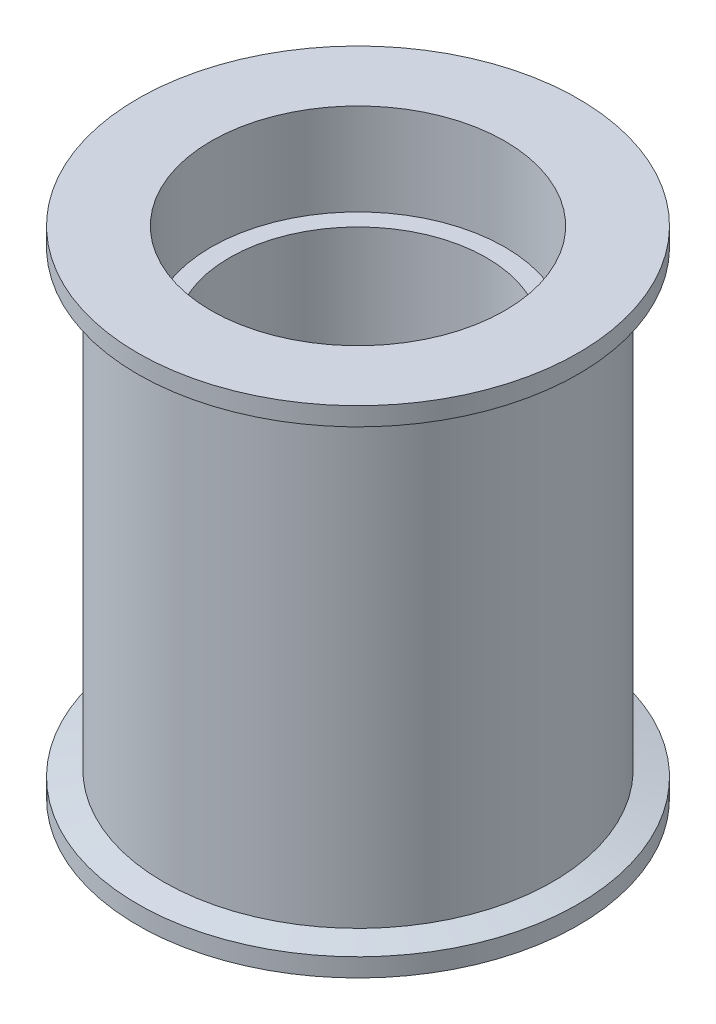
ISO-10303-21;
HEADER;
FILE_DESCRIPTION(('STEP AP214'),'2;1');
FILE_NAME('part.step','',(''),(''),'','','');
FILE_SCHEMA(('AUTOMOTIVE_DESIGN { 1 0 10303 214 1 1 1 1 }'));
ENDSEC;
DATA;
#1=APPLICATION_CONTEXT('core data for automotive mechanical design processes');
#2=APPLICATION_PROTOCOL_DEFINITION('international standard','automotive_design',2000,#1);
#3=PRODUCT_CONTEXT('',#1,'mechanical');
#4=PRODUCT('Part','Part','',(#3));
#5=PRODUCT_RELATED_PRODUCT_CATEGORY('part','',(#4));
#6=PRODUCT_DEFINITION_FORMATION('','',#4);
#7=PRODUCT_DEFINITION_CONTEXT('part definition',#1,'design');
#8=PRODUCT_DEFINITION('design','',#6,#7);
#9=PRODUCT_DEFINITION_SHAPE('','',#8);
#10=(LENGTH_UNIT() NAMED_UNIT(*) SI_UNIT(.MILLI.,.METRE.));
#11=(NAMED_UNIT(*) PLANE_ANGLE_UNIT() SI_UNIT($,.RADIAN.));
#12=(NAMED_UNIT(*) SI_UNIT($,.STERADIAN.) SOLID_ANGLE_UNIT());
#13=UNCERTAINTY_MEASURE_WITH_UNIT(LENGTH_MEASURE(1.E-05),#10,'distance_accuracy_value','');
#14=(GEOMETRIC_REPRESENTATION_CONTEXT(3) GLOBAL_UNCERTAINTY_ASSIGNED_CONTEXT((#13)) GLOBAL_UNIT_ASSIGNED_CONTEXT((#10,
#11,#12)) REPRESENTATION_CONTEXT('',''));
#15=CARTESIAN_POINT('',(0.,0.,0.));
#16=DIRECTION('',(0.,0.,1.));
#17=DIRECTION('',(1.,0.,0.));
#18=AXIS2_PLACEMENT_3D('',#15,#16,#17);
#19=CARTESIAN_POINT('',(0.,24.,0.));
#20=DIRECTION('',(0.,-1.,0.));
#21=DIRECTION('',(0.,0.,-1.));
#22=AXIS2_PLACEMENT_3D('',#19,#20,#21);
#23=CYLINDRICAL_SURFACE('',#22,10.6);
#24=CARTESIAN_POINT('',(0.,24.15,0.));
#25=DIRECTION('',(0.,1.,0.));
#26=DIRECTION('',(0.,0.,1.));
#27=AXIS2_PLACEMENT_3D('',#24,#25,#26);
#28=CIRCLE('',#27,10.6);
#29=CARTESIAN_POINT('',(0.,24.15,10.6));
#30=VERTEX_POINT('',#29);
#31=EDGE_CURVE('E10',#30,#30,#28,.F.);
#32=ORIENTED_EDGE('',*,*,#31,.T.);
#33=EDGE_LOOP('',(#32));
#34=FACE_BOUND('',#33,.T.);
#35=CARTESIAN_POINT('',(0.,-0.15,0.));
#36=DIRECTION('',(0.,-1.,0.));
#37=DIRECTION('',(0.,0.,-1.));
#38=AXIS2_PLACEMENT_3D('',#35,#36,#37);
#39=CIRCLE('',#38,10.6);
#40=CARTESIAN_POINT('',(0.,-0.15,-10.6));
#41=VERTEX_POINT('',#40);
#42=EDGE_CURVE('E39',#41,#41,#39,.F.);
#43=ORIENTED_EDGE('',*,*,#42,.T.);
#44=EDGE_LOOP('',(#43));
#45=FACE_BOUND('',#44,.T.);
#46=ADVANCED_FACE('F32',(#34,#45),#23,.T.);
#47=CARTESIAN_POINT('',(0.,-1.5,0.));
#48=DIRECTION('',(0.,1.,0.));
#49=DIRECTION('',(0.,0.,1.));
#50=AXIS2_PLACEMENT_3D('',#47,#48,#49);
#51=CYLINDRICAL_SURFACE('',#50,12.);
#52=CARTESIAN_POINT('',(0.,-0.5,0.));
#53=DIRECTION('',(0.,-1.,0.));
#54=DIRECTION('',(0.,0.,-1.));
#55=AXIS2_PLACEMENT_3D('',#52,#53,#54);
#56=CIRCLE('',#55,12.);
#57=CARTESIAN_POINT('',(0.,-0.5,-12.));
#58=VERTEX_POINT('',#57);
#59=EDGE_CURVE('E47',#58,#58,#56,.T.);
#60=ORIENTED_EDGE('',*,*,#59,.T.);
#61=EDGE_LOOP('',(#60));
#62=FACE_BOUND('',#61,.T.);
#63=CARTESIAN_POINT('',(0.,-1.5,0.));
#64=DIRECTION('',(0.,-1.,0.));
#65=DIRECTION('',(0.,0.,-1.));
#66=AXIS2_PLACEMENT_3D('',#63,#64,#65);
#67=CIRCLE('',#66,12.);
#68=CARTESIAN_POINT('',(0.,-1.5,-12.));
#69=VERTEX_POINT('',#68);
#70=EDGE_CURVE('E52',#69,#69,#67,.T.);
#71=ORIENTED_EDGE('',*,*,#70,.F.);
#72=EDGE_LOOP('',(#71));
#73=FACE_BOUND('',#72,.T.);
#74=ADVANCED_FACE('F107',(#62,#73),#51,.T.);
#75=CARTESIAN_POINT('',(0.,-1.5,0.));
#76=DIRECTION('',(0.,-1.,0.));
#77=DIRECTION('',(0.,0.,-1.));
#78=AXIS2_PLACEMENT_3D('',#75,#76,#77);
#79=PLANE('',#78);
#80=CARTESIAN_POINT('',(0.,-1.5,0.));
#81=DIRECTION('',(0.,-1.,0.));
#82=DIRECTION('',(0.,0.,-1.));
#83=AXIS2_PLACEMENT_3D('',#80,#81,#82);
#84=CIRCLE('',#83,8.);
#85=CARTESIAN_POINT('',(0.,-1.5,-8.));
#86=VERTEX_POINT('',#85);
#87=EDGE_CURVE('E59',#86,#86,#84,.T.);
#88=ORIENTED_EDGE('',*,*,#87,.F.);
#89=EDGE_LOOP('',(#88));
#90=FACE_BOUND('',#89,.T.);
#91=ORIENTED_EDGE('',*,*,#70,.T.);
#92=EDGE_LOOP('',(#91));
#93=FACE_BOUND('',#92,.T.);
#94=ADVANCED_FACE('F101',(#90,#93),#79,.T.);
#95=CARTESIAN_POINT('',(0.,25.5,0.));
#96=DIRECTION('',(0.,-1.,0.));
#97=DIRECTION('',(0.,0.,-1.));
#98=AXIS2_PLACEMENT_3D('',#95,#96,#97);
#99=CYLINDRICAL_SURFACE('',#98,12.);
#100=CARTESIAN_POINT('',(0.,24.5,0.));
#101=DIRECTION('',(0.,1.,0.));
#102=DIRECTION('',(0.,0.,1.));
#103=AXIS2_PLACEMENT_3D('',#100,#101,#102);
#104=CIRCLE('',#103,12.);
#105=CARTESIAN_POINT('',(0.,24.5,12.));
#106=VERTEX_POINT('',#105);
#107=EDGE_CURVE('E43',#106,#106,#104,.T.);
#108=ORIENTED_EDGE('',*,*,#107,.T.);
#109=EDGE_LOOP('',(#108));
#110=FACE_BOUND('',#109,.T.);
#111=CARTESIAN_POINT('',(0.,25.5,0.));
#112=DIRECTION('',(0.,1.,0.));
#113=DIRECTION('',(0.,0.,1.));
#114=AXIS2_PLACEMENT_3D('',#111,#112,#113);
#115=CIRCLE('',#114,12.);
#116=CARTESIAN_POINT('',(0.,25.5,12.));
#117=VERTEX_POINT('',#116);
#118=EDGE_CURVE('E55',#117,#117,#115,.T.);
#119=ORIENTED_EDGE('',*,*,#118,.F.);
#120=EDGE_LOOP('',(#119));
#121=FACE_BOUND('',#120,.T.);
#122=ADVANCED_FACE('F96',(#110,#121),#99,.T.);
#123=CARTESIAN_POINT('',(0.,25.5,0.));
#124=DIRECTION('',(0.,1.,0.));
#125=DIRECTION('',(0.,0.,1.));
#126=AXIS2_PLACEMENT_3D('',#123,#124,#125);
#127=PLANE('',#126);
#128=CARTESIAN_POINT('',(0.,25.5,0.));
#129=DIRECTION('',(0.,1.,0.));
#130=DIRECTION('',(0.,0.,1.));
#131=AXIS2_PLACEMENT_3D('',#128,#129,#130);
#132=CIRCLE('',#131,8.);
#133=CARTESIAN_POINT('',(0.,25.5,8.));
#134=VERTEX_POINT('',#133);
#135=EDGE_CURVE('E65',#134,#134,#132,.T.);
#136=ORIENTED_EDGE('',*,*,#135,.F.);
#137=EDGE_LOOP('',(#136));
#138=FACE_BOUND('',#137,.T.);
#139=ORIENTED_EDGE('',*,*,#118,.T.);
#140=EDGE_LOOP('',(#139));
#141=FACE_BOUND('',#140,.T.);
#142=ADVANCED_FACE('F92',(#138,#141),#127,.T.);
#143=CARTESIAN_POINT('',(0.,-0.5,0.));
#144=DIRECTION('',(0.,-1.,0.));
#145=DIRECTION('',(0.,0.,-1.));
#146=AXIS2_PLACEMENT_3D('',#143,#144,#145);
#147=CONICAL_SURFACE('',#146,12.,1.32581766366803);
#148=ORIENTED_EDGE('',*,*,#42,.F.);
#149=EDGE_LOOP('',(#148));
#150=FACE_BOUND('',#149,.T.);
#151=ORIENTED_EDGE('',*,*,#59,.F.);
#152=EDGE_LOOP('',(#151));
#153=FACE_BOUND('',#152,.T.);
#154=ADVANCED_FACE('F95',(#150,#153),#147,.T.);
#155=CARTESIAN_POINT('',(0.,24.5,0.));
#156=DIRECTION('',(0.,1.,0.));
#157=DIRECTION('',(0.,0.,1.));
#158=AXIS2_PLACEMENT_3D('',#155,#156,#157);
#159=CONICAL_SURFACE('',#158,12.,1.32581766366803);
#160=ORIENTED_EDGE('',*,*,#31,.F.);
#161=EDGE_LOOP('',(#160));
#162=FACE_BOUND('',#161,.T.);
#163=ORIENTED_EDGE('',*,*,#107,.F.);
#164=EDGE_LOOP('',(#163));
#165=FACE_BOUND('',#164,.T.);
#166=ADVANCED_FACE('F34',(#162,#165),#159,.T.);
#167=CARTESIAN_POINT('',(0.,3.5,0.));
#168=DIRECTION('',(0.,-1.,0.));
#169=DIRECTION('',(0.,0.,-1.));
#170=AXIS2_PLACEMENT_3D('',#167,#168,#169);
#171=CYLINDRICAL_SURFACE('',#170,8.);
#172=CARTESIAN_POINT('',(0.,3.5,0.));
#173=DIRECTION('',(0.,-1.,0.));
#174=DIRECTION('',(0.,0.,-1.));
#175=AXIS2_PLACEMENT_3D('',#172,#173,#174);
#176=CIRCLE('',#175,8.);
#177=CARTESIAN_POINT('',(0.,3.5,-8.));
#178=VERTEX_POINT('',#177);
#179=EDGE_CURVE('E58',#178,#178,#176,.T.);
#180=ORIENTED_EDGE('',*,*,#179,.F.);
#181=EDGE_LOOP('',(#180));
#182=FACE_BOUND('',#181,.T.);
#183=ORIENTED_EDGE('',*,*,#87,.T.);
#184=EDGE_LOOP('',(#183));
#185=FACE_BOUND('',#184,.T.);
#186=ADVANCED_FACE('F122',(#182,#185),#171,.F.);
#187=CARTESIAN_POINT('',(0.,3.5,0.));
#188=DIRECTION('',(0.,-1.,0.));
#189=DIRECTION('',(0.,0.,-1.));
#190=AXIS2_PLACEMENT_3D('',#187,#188,#189);
#191=PLANE('',#190);
#192=CARTESIAN_POINT('',(0.,3.5,0.));
#193=DIRECTION('',(0.,-1.,0.));
#194=DIRECTION('',(0.,0.,-1.));
#195=AXIS2_PLACEMENT_3D('',#192,#193,#194);
#196=CIRCLE('',#195,7.);
#197=CARTESIAN_POINT('',(0.,3.5,-7.));
#198=VERTEX_POINT('',#197);
#199=EDGE_CURVE('E68',#198,#198,#196,.T.);
#200=ORIENTED_EDGE('',*,*,#199,.F.);
#201=EDGE_LOOP('',(#200));
#202=FACE_BOUND('',#201,.T.);
#203=ORIENTED_EDGE('',*,*,#179,.T.);
#204=EDGE_LOOP('',(#203));
#205=FACE_BOUND('',#204,.T.);
#206=ADVANCED_FACE('F88',(#202,#205),#191,.T.);
#207=CARTESIAN_POINT('',(0.,20.5,0.));
#208=DIRECTION('',(0.,1.,0.));
#209=DIRECTION('',(0.,0.,1.));
#210=AXIS2_PLACEMENT_3D('',#207,#208,#209);
#211=CYLINDRICAL_SURFACE('',#210,8.);
#212=CARTESIAN_POINT('',(0.,20.5,0.));
#213=DIRECTION('',(0.,1.,0.));
#214=DIRECTION('',(0.,0.,1.));
#215=AXIS2_PLACEMENT_3D('',#212,#213,#214);
#216=CIRCLE('',#215,8.);
#217=CARTESIAN_POINT('',(0.,20.5,8.));
#218=VERTEX_POINT('',#217);
#219=EDGE_CURVE('E62',#218,#218,#216,.T.);
#220=ORIENTED_EDGE('',*,*,#219,.F.);
#221=EDGE_LOOP('',(#220));
#222=FACE_BOUND('',#221,.T.);
#223=ORIENTED_EDGE('',*,*,#135,.T.);
#224=EDGE_LOOP('',(#223));
#225=FACE_BOUND('',#224,.T.);
#226=ADVANCED_FACE('F82',(#222,#225),#211,.F.);
#227=CARTESIAN_POINT('',(0.,20.5,0.));
#228=DIRECTION('',(0.,1.,0.));
#229=DIRECTION('',(0.,0.,1.));
#230=AXIS2_PLACEMENT_3D('',#227,#228,#229);
#231=PLANE('',#230);
#232=CARTESIAN_POINT('',(0.,20.5,0.));
#233=DIRECTION('',(0.,1.,0.));
#234=DIRECTION('',(0.,0.,1.));
#235=AXIS2_PLACEMENT_3D('',#232,#233,#234);
#236=CIRCLE('',#235,7.);
#237=CARTESIAN_POINT('',(0.,20.5,7.));
#238=VERTEX_POINT('',#237);
#239=EDGE_CURVE('E73',#238,#238,#236,.T.);
#240=ORIENTED_EDGE('',*,*,#239,.F.);
#241=EDGE_LOOP('',(#240));
#242=FACE_BOUND('',#241,.T.);
#243=ORIENTED_EDGE('',*,*,#219,.T.);
#244=EDGE_LOOP('',(#243));
#245=FACE_BOUND('',#244,.T.);
#246=ADVANCED_FACE('F79',(#242,#245),#231,.T.);
#247=CARTESIAN_POINT('',(0.,-1.5,0.));
#248=DIRECTION('',(0.,1.,0.));
#249=DIRECTION('',(0.,0.,1.));
#250=AXIS2_PLACEMENT_3D('',#247,#248,#249);
#251=CYLINDRICAL_SURFACE('',#250,7.);
#252=ORIENTED_EDGE('',*,*,#199,.T.);
#253=EDGE_LOOP('',(#252));
#254=FACE_BOUND('',#253,.T.);
#255=ORIENTED_EDGE('',*,*,#239,.T.);
#256=EDGE_LOOP('',(#255));
#257=FACE_BOUND('',#256,.T.);
#258=ADVANCED_FACE('F77',(#254,#257),#251,.F.);
#259=CLOSED_SHELL('',(#46,#74,#94,#122,#142,#154,#166,#186,#206,#226,#246,#258));
#260=MANIFOLD_SOLID_BREP('B2',#259);
#261=ADVANCED_BREP_SHAPE_REPRESENTATION('',(#18,#260),#14);
#262=SHAPE_DEFINITION_REPRESENTATION(#9,#261);
ENDSEC;
END-ISO-10303-21;
